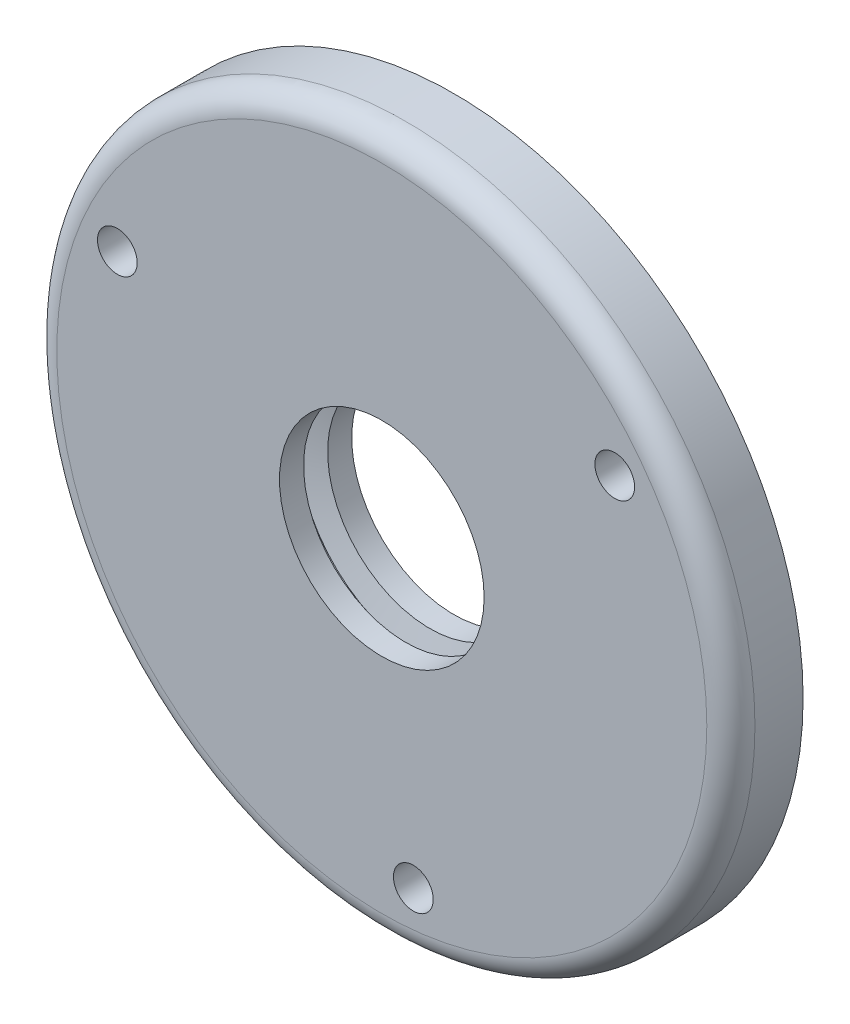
from build123d import *

# Parameters (mm, degrees)
SKETCH_1_R         = 20
SKETCH_1_R_2       = 15.704
EXTRUDE_1_DEPTH    = 4.75
SKETCH_2_R         = 29
SKETCH_2_R_2       = 8.5
EXTRUDE_2_DEPTH    = 6
HOLE_WIZARD_M4_1_D = 3.3
FILLET_1_R         = 2


with BuildPart() as part:
    # Sketch 1 → Extrude 1 (new body)
    with BuildSketch(Plane.XY.offset(1.25)):
        with Locations(Location((23.127367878, 34.541639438, 0), (0, 0, 270))):
            Circle(SKETCH_1_R)
        with Locations(Location((23.127367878, 34.541639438, 0), (0, 0, 270))):
            Circle(SKETCH_1_R_2, mode=Mode.SUBTRACT)
    extrude(amount=EXTRUDE_1_DEPTH)

    # Sketch 2 → Extrude 2 (add)
    with BuildSketch(Plane.XY.offset(6)):
        with Locations((23.127367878, 34.541639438)):
            Circle(SKETCH_2_R)
        with Locations((23.127367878, 34.541639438)):
            Circle(SKETCH_2_R_2, mode=Mode.SUBTRACT)
    extrude(amount=EXTRUDE_2_DEPTH)

    # Hole Wizard M4 _1 (through all)
    with Locations(Plane.XY.offset(12)):
        with Locations((42.478576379, 48.737791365), (1.157535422, 44.202201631), (25.745991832, 10.684925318)):
            Hole(HOLE_WIZARD_M4_1_D / 2)

    # Fillet 1
    fillet_1_edges = [part.edges().sort_by_distance(p)[0] for p in [
        (-5.872632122, 34.541639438, 12),
    ]]
    fillet(fillet_1_edges, radius=FILLET_1_R)

    # Sketch 5 → Cut-Revolve 1 (revolve, cut)
    with BuildSketch(Plane(origin=(0, 34.541639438, 0), x_dir=(-1, 0, 0), z_dir=(0, 1, 0)), mode=Mode.PRIVATE) as cut_revolve_1_sk:
        Polygon((-14.627367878, 8), (-14.627367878, 10), (-12.627367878, 9.5), (-12.627367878, 8.5), align=None)
    revolve(cut_revolve_1_sk.sketch.rotate(Axis((23.127367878, 34.541639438, 12), (0, 0, -1)), 180), axis=Axis((23.127367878, 34.541639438, 12), (0, 0, -1)), mode=Mode.SUBTRACT)


solid = part.part
